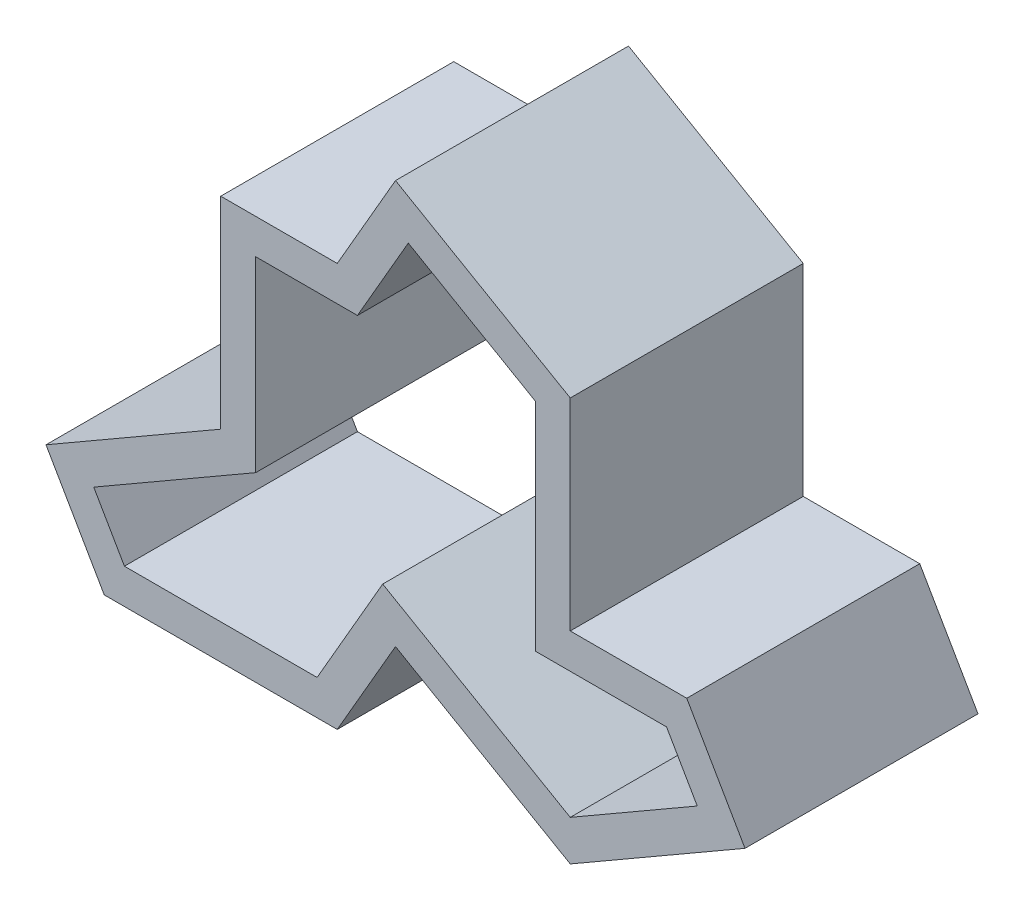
ISO-10303-21;
HEADER;
FILE_DESCRIPTION(('STEP AP214'),'2;1');
FILE_NAME('part.step','',(''),(''),'','','');
FILE_SCHEMA(('AUTOMOTIVE_DESIGN { 1 0 10303 214 1 1 1 1 }'));
ENDSEC;
DATA;
#1=APPLICATION_CONTEXT('core data for automotive mechanical design processes');
#2=APPLICATION_PROTOCOL_DEFINITION('international standard','automotive_design',2000,#1);
#3=PRODUCT_CONTEXT('',#1,'mechanical');
#4=PRODUCT('Part','Part','',(#3));
#5=PRODUCT_RELATED_PRODUCT_CATEGORY('part','',(#4));
#6=PRODUCT_DEFINITION_FORMATION('','',#4);
#7=PRODUCT_DEFINITION_CONTEXT('part definition',#1,'design');
#8=PRODUCT_DEFINITION('design','',#6,#7);
#9=PRODUCT_DEFINITION_SHAPE('','',#8);
#10=(LENGTH_UNIT() NAMED_UNIT(*) SI_UNIT(.MILLI.,.METRE.));
#11=(NAMED_UNIT(*) PLANE_ANGLE_UNIT() SI_UNIT($,.RADIAN.));
#12=(NAMED_UNIT(*) SI_UNIT($,.STERADIAN.) SOLID_ANGLE_UNIT());
#13=UNCERTAINTY_MEASURE_WITH_UNIT(LENGTH_MEASURE(1.E-05),#10,'distance_accuracy_value','');
#14=(GEOMETRIC_REPRESENTATION_CONTEXT(3) GLOBAL_UNCERTAINTY_ASSIGNED_CONTEXT((#13)) GLOBAL_UNIT_ASSIGNED_CONTEXT((#10,
#11,#12)) REPRESENTATION_CONTEXT('',''));
#15=CARTESIAN_POINT('',(0.,0.,0.));
#16=DIRECTION('',(0.,0.,1.));
#17=DIRECTION('',(1.,0.,0.));
#18=AXIS2_PLACEMENT_3D('',#15,#16,#17);
#19=CARTESIAN_POINT('',(0.,0.,20.));
#20=DIRECTION('',(0.,0.,1.));
#21=DIRECTION('',(1.,0.,0.));
#22=AXIS2_PLACEMENT_3D('',#19,#20,#21);
#23=PLANE('',#22);
#24=DIRECTION('',(0.,-1.,0.));
#25=VECTOR('',#24,1.);
#26=CARTESIAN_POINT('',(-16.2241713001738,34.134423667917,20.));
#27=LINE('',#26,#25);
#28=CARTESIAN_POINT('',(-16.2241713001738,34.134423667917,20.));
#29=VERTEX_POINT('',#28);
#30=CARTESIAN_POINT('',(-16.2241713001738,16.8139155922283,20.));
#31=VERTEX_POINT('',#30);
#32=EDGE_CURVE('E308',#29,#31,#27,.T.);
#33=ORIENTED_EDGE('',*,*,#32,.T.);
#34=DIRECTION('',(-0.866025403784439,-0.5,0.));
#35=VECTOR('',#34,1.);
#36=CARTESIAN_POINT('',(-16.2241713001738,16.8139155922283,20.));
#37=LINE('',#36,#35);
#38=CARTESIAN_POINT('',(-31.2241713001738,8.15366155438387,20.));
#39=VERTEX_POINT('',#38);
#40=EDGE_CURVE('E311',#31,#39,#37,.T.);
#41=ORIENTED_EDGE('',*,*,#40,.T.);
#42=DIRECTION('',(0.5,-0.866025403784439,0.));
#43=VECTOR('',#42,1.);
#44=CARTESIAN_POINT('',(-31.2241713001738,8.15366155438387,20.));
#45=LINE('',#44,#43);
#46=CARTESIAN_POINT('',(-26.2241713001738,-0.506592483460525,20.));
#47=VERTEX_POINT('',#46);
#48=EDGE_CURVE('E314',#39,#47,#45,.T.);
#49=ORIENTED_EDGE('',*,*,#48,.T.);
#50=DIRECTION('',(1.,0.,0.));
#51=VECTOR('',#50,1.);
#52=CARTESIAN_POINT('',(-26.2241713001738,-0.506592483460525,20.));
#53=LINE('',#52,#51);
#54=CARTESIAN_POINT('',(-6.22417130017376,-0.506592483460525,20.));
#55=VERTEX_POINT('',#54);
#56=EDGE_CURVE('E316',#47,#55,#53,.T.);
#57=ORIENTED_EDGE('',*,*,#56,.T.);
#58=DIRECTION('',(0.5,0.866025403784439,0.));
#59=VECTOR('',#58,1.);
#60=CARTESIAN_POINT('',(-6.22417130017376,-0.506592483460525,20.));
#61=LINE('',#60,#59);
#62=CARTESIAN_POINT('',(-1.22417130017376,8.15366155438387,20.));
#63=VERTEX_POINT('',#62);
#64=EDGE_CURVE('E318',#55,#63,#61,.T.);
#65=ORIENTED_EDGE('',*,*,#64,.T.);
#66=DIRECTION('',(0.866025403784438,-0.500000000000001,0.));
#67=VECTOR('',#66,1.);
#68=CARTESIAN_POINT('',(-1.22417130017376,8.15366155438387,20.));
#69=LINE('',#68,#67);
#70=CARTESIAN_POINT('',(13.7758286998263,-0.506592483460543,20.));
#71=VERTEX_POINT('',#70);
#72=EDGE_CURVE('E320',#63,#71,#69,.T.);
#73=ORIENTED_EDGE('',*,*,#72,.T.);
#74=DIRECTION('',(0.866025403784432,0.500000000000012,0.));
#75=VECTOR('',#74,1.);
#76=CARTESIAN_POINT('',(13.7758286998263,-0.506592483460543,20.));
#77=LINE('',#76,#75);
#78=CARTESIAN_POINT('',(28.7758286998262,8.15366155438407,20.));
#79=VERTEX_POINT('',#78);
#80=EDGE_CURVE('E322',#71,#79,#77,.T.);
#81=ORIENTED_EDGE('',*,*,#80,.T.);
#82=DIRECTION('',(-0.500000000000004,0.866025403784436,0.));
#83=VECTOR('',#82,1.);
#84=CARTESIAN_POINT('',(28.7758286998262,8.15366155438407,20.));
#85=LINE('',#84,#83);
#86=CARTESIAN_POINT('',(23.7758286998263,16.8139155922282,20.));
#87=VERTEX_POINT('',#86);
#88=EDGE_CURVE('E324',#79,#87,#85,.T.);
#89=ORIENTED_EDGE('',*,*,#88,.T.);
#90=DIRECTION('',(-1.,0.,0.));
#91=VECTOR('',#90,1.);
#92=CARTESIAN_POINT('',(23.7758286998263,16.8139155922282,20.));
#93=LINE('',#92,#91);
#94=CARTESIAN_POINT('',(13.7758286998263,16.8139155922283,20.));
#95=VERTEX_POINT('',#94);
#96=EDGE_CURVE('E326',#87,#95,#93,.T.);
#97=ORIENTED_EDGE('',*,*,#96,.T.);
#98=DIRECTION('',(0.,1.,0.));
#99=VECTOR('',#98,1.);
#100=CARTESIAN_POINT('',(13.7758286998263,16.8139155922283,20.));
#101=LINE('',#100,#99);
#102=CARTESIAN_POINT('',(13.7758286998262,34.134423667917,20.));
#103=VERTEX_POINT('',#102);
#104=EDGE_CURVE('E328',#95,#103,#101,.T.);
#105=ORIENTED_EDGE('',*,*,#104,.T.);
#106=DIRECTION('',(-0.866025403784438,0.500000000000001,0.));
#107=VECTOR('',#106,1.);
#108=CARTESIAN_POINT('',(13.7758286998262,34.134423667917,20.));
#109=LINE('',#108,#107);
#110=CARTESIAN_POINT('',(-1.22417130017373,42.7946777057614,20.));
#111=VERTEX_POINT('',#110);
#112=EDGE_CURVE('E330',#103,#111,#109,.T.);
#113=ORIENTED_EDGE('',*,*,#112,.T.);
#114=DIRECTION('',(-0.5,-0.866025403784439,0.));
#115=VECTOR('',#114,1.);
#116=CARTESIAN_POINT('',(-1.22417130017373,42.7946777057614,20.));
#117=LINE('',#116,#115);
#118=CARTESIAN_POINT('',(-6.22417130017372,34.134423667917,20.));
#119=VERTEX_POINT('',#118);
#120=EDGE_CURVE('E332',#111,#119,#117,.T.);
#121=ORIENTED_EDGE('',*,*,#120,.T.);
#122=DIRECTION('',(-1.,0.,0.));
#123=VECTOR('',#122,1.);
#124=CARTESIAN_POINT('',(-6.22417130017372,34.134423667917,20.));
#125=LINE('',#124,#123);
#126=EDGE_CURVE('E334',#119,#29,#125,.T.);
#127=ORIENTED_EDGE('',*,*,#126,.T.);
#128=EDGE_LOOP('',(#33,#41,#49,#57,#65,#73,#81,#89,#97,#105,#113,#121,#127));
#129=FACE_BOUND('',#128,.T.);
#130=DIRECTION('',(-0.866025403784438,0.5,0.));
#131=VECTOR('',#130,1.);
#132=CARTESIAN_POINT('',(10.7758286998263,32.4023728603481,20.));
#133=LINE('',#132,#131);
#134=CARTESIAN_POINT('',(10.7758286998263,32.4023728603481,20.));
#135=VERTEX_POINT('',#134);
#136=CARTESIAN_POINT('',(-0.126095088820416,38.6966014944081,20.));
#137=VERTEX_POINT('',#136);
#138=EDGE_CURVE('E216',#135,#137,#133,.T.);
#139=ORIENTED_EDGE('',*,*,#138,.F.);
#140=DIRECTION('',(0.,1.,0.));
#141=VECTOR('',#140,1.);
#142=CARTESIAN_POINT('',(10.7758286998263,13.8139155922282,20.));
#143=LINE('',#142,#141);
#144=CARTESIAN_POINT('',(10.7758286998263,13.8139155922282,20.));
#145=VERTEX_POINT('',#144);
#146=EDGE_CURVE('E208',#145,#135,#143,.T.);
#147=ORIENTED_EDGE('',*,*,#146,.F.);
#148=DIRECTION('',(-1.,0.,0.));
#149=VECTOR('',#148,1.);
#150=CARTESIAN_POINT('',(22.0437778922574,13.8139155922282,20.));
#151=LINE('',#150,#149);
#152=CARTESIAN_POINT('',(22.0437778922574,13.8139155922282,20.));
#153=VERTEX_POINT('',#152);
#154=EDGE_CURVE('E251',#153,#145,#151,.T.);
#155=ORIENTED_EDGE('',*,*,#154,.F.);
#156=DIRECTION('',(-0.500000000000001,0.866025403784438,0.));
#157=VECTOR('',#156,1.);
#158=CARTESIAN_POINT('',(24.677752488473,9.25173776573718,20.));
#159=LINE('',#158,#157);
#160=CARTESIAN_POINT('',(24.677752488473,9.25173776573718,20.));
#161=VERTEX_POINT('',#160);
#162=EDGE_CURVE('E249',#161,#153,#159,.T.);
#163=ORIENTED_EDGE('',*,*,#162,.F.);
#164=DIRECTION('',(0.866025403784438,0.5,0.));
#165=VECTOR('',#164,1.);
#166=CARTESIAN_POINT('',(13.7758286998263,2.95750913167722,20.));
#167=LINE('',#166,#165);
#168=CARTESIAN_POINT('',(13.7758286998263,2.95750913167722,20.));
#169=VERTEX_POINT('',#168);
#170=EDGE_CURVE('E247',#169,#161,#167,.T.);
#171=ORIENTED_EDGE('',*,*,#170,.F.);
#172=DIRECTION('',(0.866025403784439,-0.5,0.));
#173=VECTOR('',#172,1.);
#174=CARTESIAN_POINT('',(-2.32224751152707,12.2517377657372,20.));
#175=LINE('',#174,#173);
#176=CARTESIAN_POINT('',(-2.32224751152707,12.2517377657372,20.));
#177=VERTEX_POINT('',#176);
#178=EDGE_CURVE('E245',#177,#169,#175,.T.);
#179=ORIENTED_EDGE('',*,*,#178,.F.);
#180=DIRECTION('',(0.5,0.866025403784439,0.));
#181=VECTOR('',#180,1.);
#182=CARTESIAN_POINT('',(-7.95622210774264,2.49340751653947,20.));
#183=LINE('',#182,#181);
#184=CARTESIAN_POINT('',(-7.95622210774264,2.49340751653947,20.));
#185=VERTEX_POINT('',#184);
#186=EDGE_CURVE('E243',#185,#177,#183,.T.);
#187=ORIENTED_EDGE('',*,*,#186,.F.);
#188=DIRECTION('',(1.,0.,0.));
#189=VECTOR('',#188,1.);
#190=CARTESIAN_POINT('',(-24.4921204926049,2.49340751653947,20.));
#191=LINE('',#190,#189);
#192=CARTESIAN_POINT('',(-24.4921204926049,2.49340751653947,20.));
#193=VERTEX_POINT('',#192);
#194=EDGE_CURVE('E241',#193,#185,#191,.T.);
#195=ORIENTED_EDGE('',*,*,#194,.F.);
#196=DIRECTION('',(0.5,-0.866025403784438,0.));
#197=VECTOR('',#196,1.);
#198=CARTESIAN_POINT('',(-27.1260950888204,7.05558534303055,20.));
#199=LINE('',#198,#197);
#200=CARTESIAN_POINT('',(-27.1260950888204,7.05558534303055,20.));
#201=VERTEX_POINT('',#200);
#202=EDGE_CURVE('E239',#201,#193,#199,.T.);
#203=ORIENTED_EDGE('',*,*,#202,.F.);
#204=DIRECTION('',(-0.866025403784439,-0.5,0.));
#205=VECTOR('',#204,1.);
#206=CARTESIAN_POINT('',(-13.2241713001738,15.0818647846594,20.));
#207=LINE('',#206,#205);
#208=CARTESIAN_POINT('',(-13.2241713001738,15.0818647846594,20.));
#209=VERTEX_POINT('',#208);
#210=EDGE_CURVE('E237',#209,#201,#207,.T.);
#211=ORIENTED_EDGE('',*,*,#210,.F.);
#212=DIRECTION('',(0.,-1.,0.));
#213=VECTOR('',#212,1.);
#214=CARTESIAN_POINT('',(-13.2241713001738,31.134423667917,20.));
#215=LINE('',#214,#213);
#216=CARTESIAN_POINT('',(-13.2241713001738,31.134423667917,20.));
#217=VERTEX_POINT('',#216);
#218=EDGE_CURVE('E235',#217,#209,#215,.T.);
#219=ORIENTED_EDGE('',*,*,#218,.F.);
#220=DIRECTION('',(-1.,0.,0.));
#221=VECTOR('',#220,1.);
#222=CARTESIAN_POINT('',(-4.49212049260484,31.134423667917,20.));
#223=LINE('',#222,#221);
#224=CARTESIAN_POINT('',(-4.49212049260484,31.134423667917,20.));
#225=VERTEX_POINT('',#224);
#226=EDGE_CURVE('E231',#225,#217,#223,.T.);
#227=ORIENTED_EDGE('',*,*,#226,.F.);
#228=DIRECTION('',(-0.5,-0.866025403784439,0.));
#229=VECTOR('',#228,1.);
#230=CARTESIAN_POINT('',(-0.126095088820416,38.6966014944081,20.));
#231=LINE('',#230,#229);
#232=EDGE_CURVE('E229',#137,#225,#231,.T.);
#233=ORIENTED_EDGE('',*,*,#232,.F.);
#234=EDGE_LOOP('',(#139,#147,#155,#163,#171,#179,#187,#195,#203,#211,#219,#227,#233));
#235=FACE_BOUND('',#234,.T.);
#236=ADVANCED_FACE('F35',(#129,#235),#23,.T.);
#237=CARTESIAN_POINT('',(0.,0.,0.));
#238=DIRECTION('',(0.,0.,1.));
#239=DIRECTION('',(1.,0.,0.));
#240=AXIS2_PLACEMENT_3D('',#237,#238,#239);
#241=PLANE('',#240);
#242=DIRECTION('',(0.,-1.,0.));
#243=VECTOR('',#242,1.);
#244=CARTESIAN_POINT('',(-16.2241713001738,34.134423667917,0.));
#245=LINE('',#244,#243);
#246=CARTESIAN_POINT('',(-16.2241713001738,34.134423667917,0.));
#247=VERTEX_POINT('',#246);
#248=CARTESIAN_POINT('',(-16.2241713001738,16.8139155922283,0.));
#249=VERTEX_POINT('',#248);
#250=EDGE_CURVE('E224',#247,#249,#245,.T.);
#251=ORIENTED_EDGE('',*,*,#250,.F.);
#252=DIRECTION('',(-1.,0.,0.));
#253=VECTOR('',#252,1.);
#254=CARTESIAN_POINT('',(-6.22417130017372,34.134423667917,0.));
#255=LINE('',#254,#253);
#256=CARTESIAN_POINT('',(-6.22417130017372,34.134423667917,0.));
#257=VERTEX_POINT('',#256);
#258=EDGE_CURVE('E312',#257,#247,#255,.T.);
#259=ORIENTED_EDGE('',*,*,#258,.F.);
#260=DIRECTION('',(-0.5,-0.866025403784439,0.));
#261=VECTOR('',#260,1.);
#262=CARTESIAN_POINT('',(-1.22417130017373,42.7946777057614,0.));
#263=LINE('',#262,#261);
#264=CARTESIAN_POINT('',(-1.22417130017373,42.7946777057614,0.));
#265=VERTEX_POINT('',#264);
#266=EDGE_CURVE('E359',#265,#257,#263,.T.);
#267=ORIENTED_EDGE('',*,*,#266,.F.);
#268=DIRECTION('',(-0.866025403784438,0.500000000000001,0.));
#269=VECTOR('',#268,1.);
#270=CARTESIAN_POINT('',(13.7758286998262,34.134423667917,0.));
#271=LINE('',#270,#269);
#272=CARTESIAN_POINT('',(13.7758286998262,34.134423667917,0.));
#273=VERTEX_POINT('',#272);
#274=EDGE_CURVE('E357',#273,#265,#271,.T.);
#275=ORIENTED_EDGE('',*,*,#274,.F.);
#276=DIRECTION('',(0.,1.,0.));
#277=VECTOR('',#276,1.);
#278=CARTESIAN_POINT('',(13.7758286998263,16.8139155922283,0.));
#279=LINE('',#278,#277);
#280=CARTESIAN_POINT('',(13.7758286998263,16.8139155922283,0.));
#281=VERTEX_POINT('',#280);
#282=EDGE_CURVE('E355',#281,#273,#279,.T.);
#283=ORIENTED_EDGE('',*,*,#282,.F.);
#284=DIRECTION('',(-1.,0.,0.));
#285=VECTOR('',#284,1.);
#286=CARTESIAN_POINT('',(23.7758286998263,16.8139155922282,0.));
#287=LINE('',#286,#285);
#288=CARTESIAN_POINT('',(23.7758286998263,16.8139155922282,0.));
#289=VERTEX_POINT('',#288);
#290=EDGE_CURVE('E353',#289,#281,#287,.T.);
#291=ORIENTED_EDGE('',*,*,#290,.F.);
#292=DIRECTION('',(-0.500000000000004,0.866025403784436,0.));
#293=VECTOR('',#292,1.);
#294=CARTESIAN_POINT('',(28.7758286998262,8.15366155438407,0.));
#295=LINE('',#294,#293);
#296=CARTESIAN_POINT('',(28.7758286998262,8.15366155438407,0.));
#297=VERTEX_POINT('',#296);
#298=EDGE_CURVE('E351',#297,#289,#295,.T.);
#299=ORIENTED_EDGE('',*,*,#298,.F.);
#300=DIRECTION('',(0.866025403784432,0.500000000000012,0.));
#301=VECTOR('',#300,1.);
#302=CARTESIAN_POINT('',(13.7758286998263,-0.506592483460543,0.));
#303=LINE('',#302,#301);
#304=CARTESIAN_POINT('',(13.7758286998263,-0.506592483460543,0.));
#305=VERTEX_POINT('',#304);
#306=EDGE_CURVE('E349',#305,#297,#303,.T.);
#307=ORIENTED_EDGE('',*,*,#306,.F.);
#308=DIRECTION('',(0.866025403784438,-0.500000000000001,0.));
#309=VECTOR('',#308,1.);
#310=CARTESIAN_POINT('',(-1.22417130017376,8.15366155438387,0.));
#311=LINE('',#310,#309);
#312=CARTESIAN_POINT('',(-1.22417130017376,8.15366155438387,0.));
#313=VERTEX_POINT('',#312);
#314=EDGE_CURVE('E347',#313,#305,#311,.T.);
#315=ORIENTED_EDGE('',*,*,#314,.F.);
#316=DIRECTION('',(0.5,0.866025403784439,0.));
#317=VECTOR('',#316,1.);
#318=CARTESIAN_POINT('',(-6.22417130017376,-0.506592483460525,0.));
#319=LINE('',#318,#317);
#320=CARTESIAN_POINT('',(-6.22417130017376,-0.506592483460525,0.));
#321=VERTEX_POINT('',#320);
#322=EDGE_CURVE('E345',#321,#313,#319,.T.);
#323=ORIENTED_EDGE('',*,*,#322,.F.);
#324=DIRECTION('',(1.,0.,0.));
#325=VECTOR('',#324,1.);
#326=CARTESIAN_POINT('',(-26.2241713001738,-0.506592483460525,0.));
#327=LINE('',#326,#325);
#328=CARTESIAN_POINT('',(-26.2241713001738,-0.506592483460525,0.));
#329=VERTEX_POINT('',#328);
#330=EDGE_CURVE('E343',#329,#321,#327,.T.);
#331=ORIENTED_EDGE('',*,*,#330,.F.);
#332=DIRECTION('',(0.5,-0.866025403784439,0.));
#333=VECTOR('',#332,1.);
#334=CARTESIAN_POINT('',(-31.2241713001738,8.15366155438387,0.));
#335=LINE('',#334,#333);
#336=CARTESIAN_POINT('',(-31.2241713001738,8.15366155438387,0.));
#337=VERTEX_POINT('',#336);
#338=EDGE_CURVE('E341',#337,#329,#335,.T.);
#339=ORIENTED_EDGE('',*,*,#338,.F.);
#340=DIRECTION('',(-0.866025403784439,-0.5,0.));
#341=VECTOR('',#340,1.);
#342=CARTESIAN_POINT('',(-16.2241713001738,16.8139155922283,0.));
#343=LINE('',#342,#341);
#344=EDGE_CURVE('E339',#249,#337,#343,.T.);
#345=ORIENTED_EDGE('',*,*,#344,.F.);
#346=EDGE_LOOP('',(#251,#259,#267,#275,#283,#291,#299,#307,#315,#323,#331,#339,#345));
#347=FACE_BOUND('',#346,.T.);
#348=DIRECTION('',(0.,1.,0.));
#349=VECTOR('',#348,1.);
#350=CARTESIAN_POINT('',(10.7758286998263,13.8139155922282,0.));
#351=LINE('',#350,#349);
#352=CARTESIAN_POINT('',(10.7758286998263,13.8139155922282,0.));
#353=VERTEX_POINT('',#352);
#354=CARTESIAN_POINT('',(10.7758286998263,32.4023728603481,0.));
#355=VERTEX_POINT('',#354);
#356=EDGE_CURVE('E58',#353,#355,#351,.T.);
#357=ORIENTED_EDGE('',*,*,#356,.T.);
#358=DIRECTION('',(-0.866025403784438,0.5,0.));
#359=VECTOR('',#358,1.);
#360=CARTESIAN_POINT('',(10.7758286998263,32.4023728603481,0.));
#361=LINE('',#360,#359);
#362=CARTESIAN_POINT('',(-0.126095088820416,38.6966014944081,0.));
#363=VERTEX_POINT('',#362);
#364=EDGE_CURVE('E223',#355,#363,#361,.T.);
#365=ORIENTED_EDGE('',*,*,#364,.T.);
#366=DIRECTION('',(-0.5,-0.866025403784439,0.));
#367=VECTOR('',#366,1.);
#368=CARTESIAN_POINT('',(-0.126095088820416,38.6966014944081,0.));
#369=LINE('',#368,#367);
#370=CARTESIAN_POINT('',(-4.49212049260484,31.134423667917,0.));
#371=VERTEX_POINT('',#370);
#372=EDGE_CURVE('E255',#363,#371,#369,.T.);
#373=ORIENTED_EDGE('',*,*,#372,.T.);
#374=DIRECTION('',(-1.,0.,0.));
#375=VECTOR('',#374,1.);
#376=CARTESIAN_POINT('',(-4.49212049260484,31.134423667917,0.));
#377=LINE('',#376,#375);
#378=CARTESIAN_POINT('',(-13.2241713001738,31.134423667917,0.));
#379=VERTEX_POINT('',#378);
#380=EDGE_CURVE('E258',#371,#379,#377,.T.);
#381=ORIENTED_EDGE('',*,*,#380,.T.);
#382=DIRECTION('',(0.,-1.,0.));
#383=VECTOR('',#382,1.);
#384=CARTESIAN_POINT('',(-13.2241713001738,31.134423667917,0.));
#385=LINE('',#384,#383);
#386=CARTESIAN_POINT('',(-13.2241713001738,15.0818647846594,0.));
#387=VERTEX_POINT('',#386);
#388=EDGE_CURVE('E261',#379,#387,#385,.T.);
#389=ORIENTED_EDGE('',*,*,#388,.T.);
#390=DIRECTION('',(-0.866025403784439,-0.5,0.));
#391=VECTOR('',#390,1.);
#392=CARTESIAN_POINT('',(-13.2241713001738,15.0818647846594,0.));
#393=LINE('',#392,#391);
#394=CARTESIAN_POINT('',(-27.1260950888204,7.05558534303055,0.));
#395=VERTEX_POINT('',#394);
#396=EDGE_CURVE('E264',#387,#395,#393,.T.);
#397=ORIENTED_EDGE('',*,*,#396,.T.);
#398=DIRECTION('',(0.5,-0.866025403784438,0.));
#399=VECTOR('',#398,1.);
#400=CARTESIAN_POINT('',(-27.1260950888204,7.05558534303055,0.));
#401=LINE('',#400,#399);
#402=CARTESIAN_POINT('',(-24.4921204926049,2.49340751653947,0.));
#403=VERTEX_POINT('',#402);
#404=EDGE_CURVE('E267',#395,#403,#401,.T.);
#405=ORIENTED_EDGE('',*,*,#404,.T.);
#406=DIRECTION('',(1.,0.,0.));
#407=VECTOR('',#406,1.);
#408=CARTESIAN_POINT('',(-24.4921204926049,2.49340751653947,0.));
#409=LINE('',#408,#407);
#410=CARTESIAN_POINT('',(-7.95622210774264,2.49340751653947,0.));
#411=VERTEX_POINT('',#410);
#412=EDGE_CURVE('E270',#403,#411,#409,.T.);
#413=ORIENTED_EDGE('',*,*,#412,.T.);
#414=DIRECTION('',(0.5,0.866025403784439,0.));
#415=VECTOR('',#414,1.);
#416=CARTESIAN_POINT('',(-7.95622210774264,2.49340751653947,0.));
#417=LINE('',#416,#415);
#418=CARTESIAN_POINT('',(-2.32224751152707,12.2517377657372,0.));
#419=VERTEX_POINT('',#418);
#420=EDGE_CURVE('E273',#411,#419,#417,.T.);
#421=ORIENTED_EDGE('',*,*,#420,.T.);
#422=DIRECTION('',(0.866025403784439,-0.5,0.));
#423=VECTOR('',#422,1.);
#424=CARTESIAN_POINT('',(-2.32224751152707,12.2517377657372,0.));
#425=LINE('',#424,#423);
#426=CARTESIAN_POINT('',(13.7758286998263,2.95750913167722,0.));
#427=VERTEX_POINT('',#426);
#428=EDGE_CURVE('E276',#419,#427,#425,.T.);
#429=ORIENTED_EDGE('',*,*,#428,.T.);
#430=DIRECTION('',(0.866025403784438,0.5,0.));
#431=VECTOR('',#430,1.);
#432=CARTESIAN_POINT('',(13.7758286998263,2.95750913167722,0.));
#433=LINE('',#432,#431);
#434=CARTESIAN_POINT('',(24.677752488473,9.25173776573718,0.));
#435=VERTEX_POINT('',#434);
#436=EDGE_CURVE('E279',#427,#435,#433,.T.);
#437=ORIENTED_EDGE('',*,*,#436,.T.);
#438=DIRECTION('',(-0.500000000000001,0.866025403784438,0.));
#439=VECTOR('',#438,1.);
#440=CARTESIAN_POINT('',(24.677752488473,9.25173776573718,0.));
#441=LINE('',#440,#439);
#442=CARTESIAN_POINT('',(22.0437778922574,13.8139155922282,0.));
#443=VERTEX_POINT('',#442);
#444=EDGE_CURVE('E282',#435,#443,#441,.T.);
#445=ORIENTED_EDGE('',*,*,#444,.T.);
#446=DIRECTION('',(-1.,0.,0.));
#447=VECTOR('',#446,1.);
#448=CARTESIAN_POINT('',(22.0437778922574,13.8139155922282,0.));
#449=LINE('',#448,#447);
#450=EDGE_CURVE('E217',#443,#353,#449,.T.);
#451=ORIENTED_EDGE('',*,*,#450,.T.);
#452=EDGE_LOOP('',(#357,#365,#373,#381,#389,#397,#405,#413,#421,#429,#437,#445,#451));
#453=FACE_BOUND('',#452,.T.);
#454=ADVANCED_FACE('F404',(#347,#453),#241,.F.);
#455=CARTESIAN_POINT('',(-16.2241713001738,34.134423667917,20.));
#456=DIRECTION('',(1.,0.,0.));
#457=DIRECTION('',(0.,1.,0.));
#458=AXIS2_PLACEMENT_3D('',#455,#456,#457);
#459=PLANE('',#458);
#460=ORIENTED_EDGE('',*,*,#250,.T.);
#461=DIRECTION('',(0.,0.,-1.));
#462=VECTOR('',#461,1.);
#463=CARTESIAN_POINT('',(-16.2241713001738,16.8139155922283,20.));
#464=LINE('',#463,#462);
#465=EDGE_CURVE('E11',#31,#249,#464,.T.);
#466=ORIENTED_EDGE('',*,*,#465,.F.);
#467=ORIENTED_EDGE('',*,*,#32,.F.);
#468=DIRECTION('',(0.,0.,-1.));
#469=VECTOR('',#468,1.);
#470=CARTESIAN_POINT('',(-16.2241713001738,34.134423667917,20.));
#471=LINE('',#470,#469);
#472=EDGE_CURVE('E336',#29,#247,#471,.T.);
#473=ORIENTED_EDGE('',*,*,#472,.T.);
#474=EDGE_LOOP('',(#460,#466,#467,#473));
#475=FACE_BOUND('',#474,.T.);
#476=ADVANCED_FACE('F37',(#475),#459,.F.);
#477=CARTESIAN_POINT('',(-16.2241713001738,16.8139155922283,20.));
#478=DIRECTION('',(0.5,-0.866025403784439,0.));
#479=DIRECTION('',(0.866025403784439,0.5,0.));
#480=AXIS2_PLACEMENT_3D('',#477,#478,#479);
#481=PLANE('',#480);
#482=ORIENTED_EDGE('',*,*,#344,.T.);
#483=DIRECTION('',(0.,0.,-1.));
#484=VECTOR('',#483,1.);
#485=CARTESIAN_POINT('',(-31.2241713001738,8.15366155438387,20.));
#486=LINE('',#485,#484);
#487=EDGE_CURVE('E43',#39,#337,#486,.T.);
#488=ORIENTED_EDGE('',*,*,#487,.F.);
#489=ORIENTED_EDGE('',*,*,#40,.F.);
#490=ORIENTED_EDGE('',*,*,#465,.T.);
#491=EDGE_LOOP('',(#482,#488,#489,#490));
#492=FACE_BOUND('',#491,.T.);
#493=ADVANCED_FACE('F421',(#492),#481,.F.);
#494=CARTESIAN_POINT('',(-31.2241713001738,8.15366155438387,20.));
#495=DIRECTION('',(0.866025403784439,0.5,0.));
#496=DIRECTION('',(-0.5,0.866025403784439,0.));
#497=AXIS2_PLACEMENT_3D('',#494,#495,#496);
#498=PLANE('',#497);
#499=ORIENTED_EDGE('',*,*,#338,.T.);
#500=DIRECTION('',(0.,0.,-1.));
#501=VECTOR('',#500,1.);
#502=CARTESIAN_POINT('',(-26.2241713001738,-0.506592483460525,20.));
#503=LINE('',#502,#501);
#504=EDGE_CURVE('E391',#47,#329,#503,.T.);
#505=ORIENTED_EDGE('',*,*,#504,.F.);
#506=ORIENTED_EDGE('',*,*,#48,.F.);
#507=ORIENTED_EDGE('',*,*,#487,.T.);
#508=EDGE_LOOP('',(#499,#505,#506,#507));
#509=FACE_BOUND('',#508,.T.);
#510=ADVANCED_FACE('F398',(#509),#498,.F.);
#511=CARTESIAN_POINT('',(-26.2241713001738,-0.506592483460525,20.));
#512=DIRECTION('',(0.,1.,0.));
#513=DIRECTION('',(0.,0.,1.));
#514=AXIS2_PLACEMENT_3D('',#511,#512,#513);
#515=PLANE('',#514);
#516=ORIENTED_EDGE('',*,*,#330,.T.);
#517=DIRECTION('',(0.,0.,-1.));
#518=VECTOR('',#517,1.);
#519=CARTESIAN_POINT('',(-6.22417130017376,-0.506592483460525,20.));
#520=LINE('',#519,#518);
#521=EDGE_CURVE('E388',#55,#321,#520,.T.);
#522=ORIENTED_EDGE('',*,*,#521,.F.);
#523=ORIENTED_EDGE('',*,*,#56,.F.);
#524=ORIENTED_EDGE('',*,*,#504,.T.);
#525=EDGE_LOOP('',(#516,#522,#523,#524));
#526=FACE_BOUND('',#525,.T.);
#527=ADVANCED_FACE('F410',(#526),#515,.F.);
#528=CARTESIAN_POINT('',(-6.22417130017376,-0.506592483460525,20.));
#529=DIRECTION('',(-0.866025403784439,0.5,0.));
#530=DIRECTION('',(-0.5,-0.866025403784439,0.));
#531=AXIS2_PLACEMENT_3D('',#528,#529,#530);
#532=PLANE('',#531);
#533=ORIENTED_EDGE('',*,*,#322,.T.);
#534=DIRECTION('',(0.,0.,-1.));
#535=VECTOR('',#534,1.);
#536=CARTESIAN_POINT('',(-1.22417130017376,8.15366155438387,20.));
#537=LINE('',#536,#535);
#538=EDGE_CURVE('E385',#63,#313,#537,.T.);
#539=ORIENTED_EDGE('',*,*,#538,.F.);
#540=ORIENTED_EDGE('',*,*,#64,.F.);
#541=ORIENTED_EDGE('',*,*,#521,.T.);
#542=EDGE_LOOP('',(#533,#539,#540,#541));
#543=FACE_BOUND('',#542,.T.);
#544=ADVANCED_FACE('F414',(#543),#532,.F.);
#545=CARTESIAN_POINT('',(-1.22417130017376,8.15366155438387,20.));
#546=DIRECTION('',(0.500000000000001,0.866025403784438,0.));
#547=DIRECTION('',(-0.866025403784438,0.500000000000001,0.));
#548=AXIS2_PLACEMENT_3D('',#545,#546,#547);
#549=PLANE('',#548);
#550=ORIENTED_EDGE('',*,*,#314,.T.);
#551=DIRECTION('',(0.,0.,-1.));
#552=VECTOR('',#551,1.);
#553=CARTESIAN_POINT('',(13.7758286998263,-0.506592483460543,20.));
#554=LINE('',#553,#552);
#555=EDGE_CURVE('E382',#71,#305,#554,.T.);
#556=ORIENTED_EDGE('',*,*,#555,.F.);
#557=ORIENTED_EDGE('',*,*,#72,.F.);
#558=ORIENTED_EDGE('',*,*,#538,.T.);
#559=EDGE_LOOP('',(#550,#556,#557,#558));
#560=FACE_BOUND('',#559,.T.);
#561=ADVANCED_FACE('F459',(#560),#549,.F.);
#562=CARTESIAN_POINT('',(13.7758286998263,-0.506592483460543,20.));
#563=DIRECTION('',(-0.500000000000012,0.866025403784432,0.));
#564=DIRECTION('',(-0.866025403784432,-0.500000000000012,0.));
#565=AXIS2_PLACEMENT_3D('',#562,#563,#564);
#566=PLANE('',#565);
#567=ORIENTED_EDGE('',*,*,#306,.T.);
#568=DIRECTION('',(0.,0.,-1.));
#569=VECTOR('',#568,1.);
#570=CARTESIAN_POINT('',(28.7758286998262,8.15366155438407,20.));
#571=LINE('',#570,#569);
#572=EDGE_CURVE('E379',#79,#297,#571,.T.);
#573=ORIENTED_EDGE('',*,*,#572,.F.);
#574=ORIENTED_EDGE('',*,*,#80,.F.);
#575=ORIENTED_EDGE('',*,*,#555,.T.);
#576=EDGE_LOOP('',(#567,#573,#574,#575));
#577=FACE_BOUND('',#576,.T.);
#578=ADVANCED_FACE('F456',(#577),#566,.F.);
#579=CARTESIAN_POINT('',(28.7758286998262,8.15366155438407,20.));
#580=DIRECTION('',(-0.866025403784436,-0.500000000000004,0.));
#581=DIRECTION('',(0.500000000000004,-0.866025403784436,0.));
#582=AXIS2_PLACEMENT_3D('',#579,#580,#581);
#583=PLANE('',#582);
#584=ORIENTED_EDGE('',*,*,#298,.T.);
#585=DIRECTION('',(0.,0.,-1.));
#586=VECTOR('',#585,1.);
#587=CARTESIAN_POINT('',(23.7758286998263,16.8139155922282,20.));
#588=LINE('',#587,#586);
#589=EDGE_CURVE('E376',#87,#289,#588,.T.);
#590=ORIENTED_EDGE('',*,*,#589,.F.);
#591=ORIENTED_EDGE('',*,*,#88,.F.);
#592=ORIENTED_EDGE('',*,*,#572,.T.);
#593=EDGE_LOOP('',(#584,#590,#591,#592));
#594=FACE_BOUND('',#593,.T.);
#595=ADVANCED_FACE('F452',(#594),#583,.F.);
#596=CARTESIAN_POINT('',(23.7758286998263,16.8139155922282,20.));
#597=DIRECTION('',(0.,-1.,0.));
#598=DIRECTION('',(1.,0.,0.));
#599=AXIS2_PLACEMENT_3D('',#596,#597,#598);
#600=PLANE('',#599);
#601=ORIENTED_EDGE('',*,*,#290,.T.);
#602=DIRECTION('',(0.,0.,-1.));
#603=VECTOR('',#602,1.);
#604=CARTESIAN_POINT('',(13.7758286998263,16.8139155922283,20.));
#605=LINE('',#604,#603);
#606=EDGE_CURVE('E373',#95,#281,#605,.T.);
#607=ORIENTED_EDGE('',*,*,#606,.F.);
#608=ORIENTED_EDGE('',*,*,#96,.F.);
#609=ORIENTED_EDGE('',*,*,#589,.T.);
#610=EDGE_LOOP('',(#601,#607,#608,#609));
#611=FACE_BOUND('',#610,.T.);
#612=ADVANCED_FACE('F448',(#611),#600,.F.);
#613=CARTESIAN_POINT('',(13.7758286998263,16.8139155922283,20.));
#614=DIRECTION('',(-1.,0.,0.));
#615=DIRECTION('',(0.,-1.,0.));
#616=AXIS2_PLACEMENT_3D('',#613,#614,#615);
#617=PLANE('',#616);
#618=ORIENTED_EDGE('',*,*,#282,.T.);
#619=DIRECTION('',(0.,0.,-1.));
#620=VECTOR('',#619,1.);
#621=CARTESIAN_POINT('',(13.7758286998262,34.134423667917,20.));
#622=LINE('',#621,#620);
#623=EDGE_CURVE('E370',#103,#273,#622,.T.);
#624=ORIENTED_EDGE('',*,*,#623,.F.);
#625=ORIENTED_EDGE('',*,*,#104,.F.);
#626=ORIENTED_EDGE('',*,*,#606,.T.);
#627=EDGE_LOOP('',(#618,#624,#625,#626));
#628=FACE_BOUND('',#627,.T.);
#629=ADVANCED_FACE('F443',(#628),#617,.F.);
#630=CARTESIAN_POINT('',(13.7758286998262,34.134423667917,20.));
#631=DIRECTION('',(-0.500000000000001,-0.866025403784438,0.));
#632=DIRECTION('',(0.866025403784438,-0.500000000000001,0.));
#633=AXIS2_PLACEMENT_3D('',#630,#631,#632);
#634=PLANE('',#633);
#635=ORIENTED_EDGE('',*,*,#274,.T.);
#636=DIRECTION('',(0.,0.,-1.));
#637=VECTOR('',#636,1.);
#638=CARTESIAN_POINT('',(-1.22417130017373,42.7946777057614,20.));
#639=LINE('',#638,#637);
#640=EDGE_CURVE('E367',#111,#265,#639,.T.);
#641=ORIENTED_EDGE('',*,*,#640,.F.);
#642=ORIENTED_EDGE('',*,*,#112,.F.);
#643=ORIENTED_EDGE('',*,*,#623,.T.);
#644=EDGE_LOOP('',(#635,#641,#642,#643));
#645=FACE_BOUND('',#644,.T.);
#646=ADVANCED_FACE('F437',(#645),#634,.F.);
#647=CARTESIAN_POINT('',(-1.22417130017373,42.7946777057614,20.));
#648=DIRECTION('',(0.866025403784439,-0.5,0.));
#649=DIRECTION('',(0.5,0.866025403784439,0.));
#650=AXIS2_PLACEMENT_3D('',#647,#648,#649);
#651=PLANE('',#650);
#652=ORIENTED_EDGE('',*,*,#266,.T.);
#653=DIRECTION('',(0.,0.,-1.));
#654=VECTOR('',#653,1.);
#655=CARTESIAN_POINT('',(-6.22417130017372,34.134423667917,20.));
#656=LINE('',#655,#654);
#657=EDGE_CURVE('E364',#119,#257,#656,.T.);
#658=ORIENTED_EDGE('',*,*,#657,.F.);
#659=ORIENTED_EDGE('',*,*,#120,.F.);
#660=ORIENTED_EDGE('',*,*,#640,.T.);
#661=EDGE_LOOP('',(#652,#658,#659,#660));
#662=FACE_BOUND('',#661,.T.);
#663=ADVANCED_FACE('F433',(#662),#651,.F.);
#664=CARTESIAN_POINT('',(-6.22417130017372,34.134423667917,20.));
#665=DIRECTION('',(0.,-1.,0.));
#666=DIRECTION('',(1.,0.,0.));
#667=AXIS2_PLACEMENT_3D('',#664,#665,#666);
#668=PLANE('',#667);
#669=ORIENTED_EDGE('',*,*,#258,.T.);
#670=ORIENTED_EDGE('',*,*,#472,.F.);
#671=ORIENTED_EDGE('',*,*,#126,.F.);
#672=ORIENTED_EDGE('',*,*,#657,.T.);
#673=EDGE_LOOP('',(#669,#670,#671,#672));
#674=FACE_BOUND('',#673,.T.);
#675=ADVANCED_FACE('F428',(#674),#668,.F.);
#676=CARTESIAN_POINT('',(10.7758286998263,13.8139155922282,20.));
#677=DIRECTION('',(-1.,0.,0.));
#678=DIRECTION('',(0.,0.,1.));
#679=AXIS2_PLACEMENT_3D('',#676,#677,#678);
#680=PLANE('',#679);
#681=ORIENTED_EDGE('',*,*,#356,.F.);
#682=DIRECTION('',(0.,0.,-1.));
#683=VECTOR('',#682,1.);
#684=CARTESIAN_POINT('',(10.7758286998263,13.8139155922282,20.));
#685=LINE('',#684,#683);
#686=EDGE_CURVE('E212',#145,#353,#685,.T.);
#687=ORIENTED_EDGE('',*,*,#686,.F.);
#688=ORIENTED_EDGE('',*,*,#146,.T.);
#689=DIRECTION('',(0.,0.,-1.));
#690=VECTOR('',#689,1.);
#691=CARTESIAN_POINT('',(10.7758286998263,32.4023728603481,20.));
#692=LINE('',#691,#690);
#693=EDGE_CURVE('E211',#135,#355,#692,.T.);
#694=ORIENTED_EDGE('',*,*,#693,.T.);
#695=EDGE_LOOP('',(#681,#687,#688,#694));
#696=FACE_BOUND('',#695,.T.);
#697=ADVANCED_FACE('F210',(#696),#680,.T.);
#698=CARTESIAN_POINT('',(10.7758286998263,32.4023728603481,20.));
#699=DIRECTION('',(-0.5,-0.866025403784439,0.));
#700=DIRECTION('',(0.866025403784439,-0.5,0.));
#701=AXIS2_PLACEMENT_3D('',#698,#699,#700);
#702=PLANE('',#701);
#703=ORIENTED_EDGE('',*,*,#364,.F.);
#704=ORIENTED_EDGE('',*,*,#693,.F.);
#705=ORIENTED_EDGE('',*,*,#138,.T.);
#706=DIRECTION('',(0.,0.,-1.));
#707=VECTOR('',#706,1.);
#708=CARTESIAN_POINT('',(-0.126095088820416,38.6966014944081,20.));
#709=LINE('',#708,#707);
#710=EDGE_CURVE('E225',#137,#363,#709,.T.);
#711=ORIENTED_EDGE('',*,*,#710,.T.);
#712=EDGE_LOOP('',(#703,#704,#705,#711));
#713=FACE_BOUND('',#712,.T.);
#714=ADVANCED_FACE('F220',(#713),#702,.T.);
#715=CARTESIAN_POINT('',(-0.126095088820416,38.6966014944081,20.));
#716=DIRECTION('',(0.866025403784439,-0.5,0.));
#717=DIRECTION('',(0.5,0.866025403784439,0.));
#718=AXIS2_PLACEMENT_3D('',#715,#716,#717);
#719=PLANE('',#718);
#720=ORIENTED_EDGE('',*,*,#372,.F.);
#721=ORIENTED_EDGE('',*,*,#710,.F.);
#722=ORIENTED_EDGE('',*,*,#232,.T.);
#723=DIRECTION('',(0.,0.,-1.));
#724=VECTOR('',#723,1.);
#725=CARTESIAN_POINT('',(-4.49212049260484,31.134423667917,20.));
#726=LINE('',#725,#724);
#727=EDGE_CURVE('E305',#225,#371,#726,.T.);
#728=ORIENTED_EDGE('',*,*,#727,.T.);
#729=EDGE_LOOP('',(#720,#721,#722,#728));
#730=FACE_BOUND('',#729,.T.);
#731=ADVANCED_FACE('F523',(#730),#719,.T.);
#732=CARTESIAN_POINT('',(-4.49212049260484,31.134423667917,20.));
#733=DIRECTION('',(0.,-1.,0.));
#734=DIRECTION('',(0.,0.,-1.));
#735=AXIS2_PLACEMENT_3D('',#732,#733,#734);
#736=PLANE('',#735);
#737=ORIENTED_EDGE('',*,*,#380,.F.);
#738=ORIENTED_EDGE('',*,*,#727,.F.);
#739=ORIENTED_EDGE('',*,*,#226,.T.);
#740=DIRECTION('',(0.,0.,-1.));
#741=VECTOR('',#740,1.);
#742=CARTESIAN_POINT('',(-13.2241713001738,31.134423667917,20.));
#743=LINE('',#742,#741);
#744=EDGE_CURVE('E303',#217,#379,#743,.T.);
#745=ORIENTED_EDGE('',*,*,#744,.T.);
#746=EDGE_LOOP('',(#737,#738,#739,#745));
#747=FACE_BOUND('',#746,.T.);
#748=ADVANCED_FACE('F529',(#747),#736,.T.);
#749=CARTESIAN_POINT('',(-13.2241713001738,31.134423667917,20.));
#750=DIRECTION('',(1.,0.,0.));
#751=DIRECTION('',(0.,0.,-1.));
#752=AXIS2_PLACEMENT_3D('',#749,#750,#751);
#753=PLANE('',#752);
#754=ORIENTED_EDGE('',*,*,#388,.F.);
#755=ORIENTED_EDGE('',*,*,#744,.F.);
#756=ORIENTED_EDGE('',*,*,#218,.T.);
#757=DIRECTION('',(0.,0.,-1.));
#758=VECTOR('',#757,1.);
#759=CARTESIAN_POINT('',(-13.2241713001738,15.0818647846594,20.));
#760=LINE('',#759,#758);
#761=EDGE_CURVE('E301',#209,#387,#760,.T.);
#762=ORIENTED_EDGE('',*,*,#761,.T.);
#763=EDGE_LOOP('',(#754,#755,#756,#762));
#764=FACE_BOUND('',#763,.T.);
#765=ADVANCED_FACE('F537',(#764),#753,.T.);
#766=CARTESIAN_POINT('',(-13.2241713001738,15.0818647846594,20.));
#767=DIRECTION('',(0.5,-0.866025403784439,0.));
#768=DIRECTION('',(0.866025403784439,0.5,0.));
#769=AXIS2_PLACEMENT_3D('',#766,#767,#768);
#770=PLANE('',#769);
#771=ORIENTED_EDGE('',*,*,#396,.F.);
#772=ORIENTED_EDGE('',*,*,#761,.F.);
#773=ORIENTED_EDGE('',*,*,#210,.T.);
#774=DIRECTION('',(0.,0.,-1.));
#775=VECTOR('',#774,1.);
#776=CARTESIAN_POINT('',(-27.1260950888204,7.05558534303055,20.));
#777=LINE('',#776,#775);
#778=EDGE_CURVE('E299',#201,#395,#777,.T.);
#779=ORIENTED_EDGE('',*,*,#778,.T.);
#780=EDGE_LOOP('',(#771,#772,#773,#779));
#781=FACE_BOUND('',#780,.T.);
#782=ADVANCED_FACE('F545',(#781),#770,.T.);
#783=CARTESIAN_POINT('',(-27.1260950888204,7.05558534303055,20.));
#784=DIRECTION('',(0.866025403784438,0.5,0.));
#785=DIRECTION('',(-0.5,0.866025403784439,0.));
#786=AXIS2_PLACEMENT_3D('',#783,#784,#785);
#787=PLANE('',#786);
#788=ORIENTED_EDGE('',*,*,#404,.F.);
#789=ORIENTED_EDGE('',*,*,#778,.F.);
#790=ORIENTED_EDGE('',*,*,#202,.T.);
#791=DIRECTION('',(0.,0.,-1.));
#792=VECTOR('',#791,1.);
#793=CARTESIAN_POINT('',(-24.4921204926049,2.49340751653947,20.));
#794=LINE('',#793,#792);
#795=EDGE_CURVE('E297',#193,#403,#794,.T.);
#796=ORIENTED_EDGE('',*,*,#795,.T.);
#797=EDGE_LOOP('',(#788,#789,#790,#796));
#798=FACE_BOUND('',#797,.T.);
#799=ADVANCED_FACE('F553',(#798),#787,.T.);
#800=CARTESIAN_POINT('',(-24.4921204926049,2.49340751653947,20.));
#801=DIRECTION('',(0.,1.,0.));
#802=DIRECTION('',(0.,0.,1.));
#803=AXIS2_PLACEMENT_3D('',#800,#801,#802);
#804=PLANE('',#803);
#805=ORIENTED_EDGE('',*,*,#412,.F.);
#806=ORIENTED_EDGE('',*,*,#795,.F.);
#807=ORIENTED_EDGE('',*,*,#194,.T.);
#808=DIRECTION('',(0.,0.,-1.));
#809=VECTOR('',#808,1.);
#810=CARTESIAN_POINT('',(-7.95622210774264,2.49340751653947,20.));
#811=LINE('',#810,#809);
#812=EDGE_CURVE('E295',#185,#411,#811,.T.);
#813=ORIENTED_EDGE('',*,*,#812,.T.);
#814=EDGE_LOOP('',(#805,#806,#807,#813));
#815=FACE_BOUND('',#814,.T.);
#816=ADVANCED_FACE('F561',(#815),#804,.T.);
#817=CARTESIAN_POINT('',(-7.95622210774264,2.49340751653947,20.));
#818=DIRECTION('',(-0.866025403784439,0.5,0.));
#819=DIRECTION('',(-0.5,-0.866025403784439,0.));
#820=AXIS2_PLACEMENT_3D('',#817,#818,#819);
#821=PLANE('',#820);
#822=ORIENTED_EDGE('',*,*,#420,.F.);
#823=ORIENTED_EDGE('',*,*,#812,.F.);
#824=ORIENTED_EDGE('',*,*,#186,.T.);
#825=DIRECTION('',(0.,0.,-1.));
#826=VECTOR('',#825,1.);
#827=CARTESIAN_POINT('',(-2.32224751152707,12.2517377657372,20.));
#828=LINE('',#827,#826);
#829=EDGE_CURVE('E293',#177,#419,#828,.T.);
#830=ORIENTED_EDGE('',*,*,#829,.T.);
#831=EDGE_LOOP('',(#822,#823,#824,#830));
#832=FACE_BOUND('',#831,.T.);
#833=ADVANCED_FACE('F569',(#832),#821,.T.);
#834=CARTESIAN_POINT('',(-2.32224751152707,12.2517377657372,20.));
#835=DIRECTION('',(0.5,0.866025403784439,0.));
#836=DIRECTION('',(-0.866025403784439,0.5,0.));
#837=AXIS2_PLACEMENT_3D('',#834,#835,#836);
#838=PLANE('',#837);
#839=ORIENTED_EDGE('',*,*,#428,.F.);
#840=ORIENTED_EDGE('',*,*,#829,.F.);
#841=ORIENTED_EDGE('',*,*,#178,.T.);
#842=DIRECTION('',(0.,0.,-1.));
#843=VECTOR('',#842,1.);
#844=CARTESIAN_POINT('',(13.7758286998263,2.95750913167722,20.));
#845=LINE('',#844,#843);
#846=EDGE_CURVE('E291',#169,#427,#845,.T.);
#847=ORIENTED_EDGE('',*,*,#846,.T.);
#848=EDGE_LOOP('',(#839,#840,#841,#847));
#849=FACE_BOUND('',#848,.T.);
#850=ADVANCED_FACE('F577',(#849),#838,.T.);
#851=CARTESIAN_POINT('',(13.7758286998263,2.95750913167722,20.));
#852=DIRECTION('',(-0.5,0.866025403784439,0.));
#853=DIRECTION('',(-0.866025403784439,-0.5,0.));
#854=AXIS2_PLACEMENT_3D('',#851,#852,#853);
#855=PLANE('',#854);
#856=ORIENTED_EDGE('',*,*,#436,.F.);
#857=ORIENTED_EDGE('',*,*,#846,.F.);
#858=ORIENTED_EDGE('',*,*,#170,.T.);
#859=DIRECTION('',(0.,0.,-1.));
#860=VECTOR('',#859,1.);
#861=CARTESIAN_POINT('',(24.677752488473,9.25173776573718,20.));
#862=LINE('',#861,#860);
#863=EDGE_CURVE('E289',#161,#435,#862,.T.);
#864=ORIENTED_EDGE('',*,*,#863,.T.);
#865=EDGE_LOOP('',(#856,#857,#858,#864));
#866=FACE_BOUND('',#865,.T.);
#867=ADVANCED_FACE('F585',(#866),#855,.T.);
#868=CARTESIAN_POINT('',(24.677752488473,9.25173776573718,20.));
#869=DIRECTION('',(-0.866025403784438,-0.500000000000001,0.));
#870=DIRECTION('',(0.500000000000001,-0.866025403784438,0.));
#871=AXIS2_PLACEMENT_3D('',#868,#869,#870);
#872=PLANE('',#871);
#873=ORIENTED_EDGE('',*,*,#444,.F.);
#874=ORIENTED_EDGE('',*,*,#863,.F.);
#875=ORIENTED_EDGE('',*,*,#162,.T.);
#876=DIRECTION('',(0.,0.,-1.));
#877=VECTOR('',#876,1.);
#878=CARTESIAN_POINT('',(22.0437778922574,13.8139155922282,20.));
#879=LINE('',#878,#877);
#880=EDGE_CURVE('E50',#153,#443,#879,.T.);
#881=ORIENTED_EDGE('',*,*,#880,.T.);
#882=EDGE_LOOP('',(#873,#874,#875,#881));
#883=FACE_BOUND('',#882,.T.);
#884=ADVANCED_FACE('F593',(#883),#872,.T.);
#885=CARTESIAN_POINT('',(22.0437778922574,13.8139155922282,20.));
#886=DIRECTION('',(0.,-1.,0.));
#887=DIRECTION('',(0.,0.,-1.));
#888=AXIS2_PLACEMENT_3D('',#885,#886,#887);
#889=PLANE('',#888);
#890=ORIENTED_EDGE('',*,*,#450,.F.);
#891=ORIENTED_EDGE('',*,*,#880,.F.);
#892=ORIENTED_EDGE('',*,*,#154,.T.);
#893=ORIENTED_EDGE('',*,*,#686,.T.);
#894=EDGE_LOOP('',(#890,#891,#892,#893));
#895=FACE_BOUND('',#894,.T.);
#896=ADVANCED_FACE('F601',(#895),#889,.T.);
#897=CLOSED_SHELL('',(#236,#454,#476,#493,#510,#527,#544,#561,#578,#595,#612,#629,#646,#663,
#675,#697,#714,#731,#748,#765,#782,#799,#816,#833,#850,#867,#884,#896));
#898=MANIFOLD_SOLID_BREP('B2',#897);
#899=ADVANCED_BREP_SHAPE_REPRESENTATION('',(#18,#898),#14);
#900=SHAPE_DEFINITION_REPRESENTATION(#9,#899);
ENDSEC;
END-ISO-10303-21;
